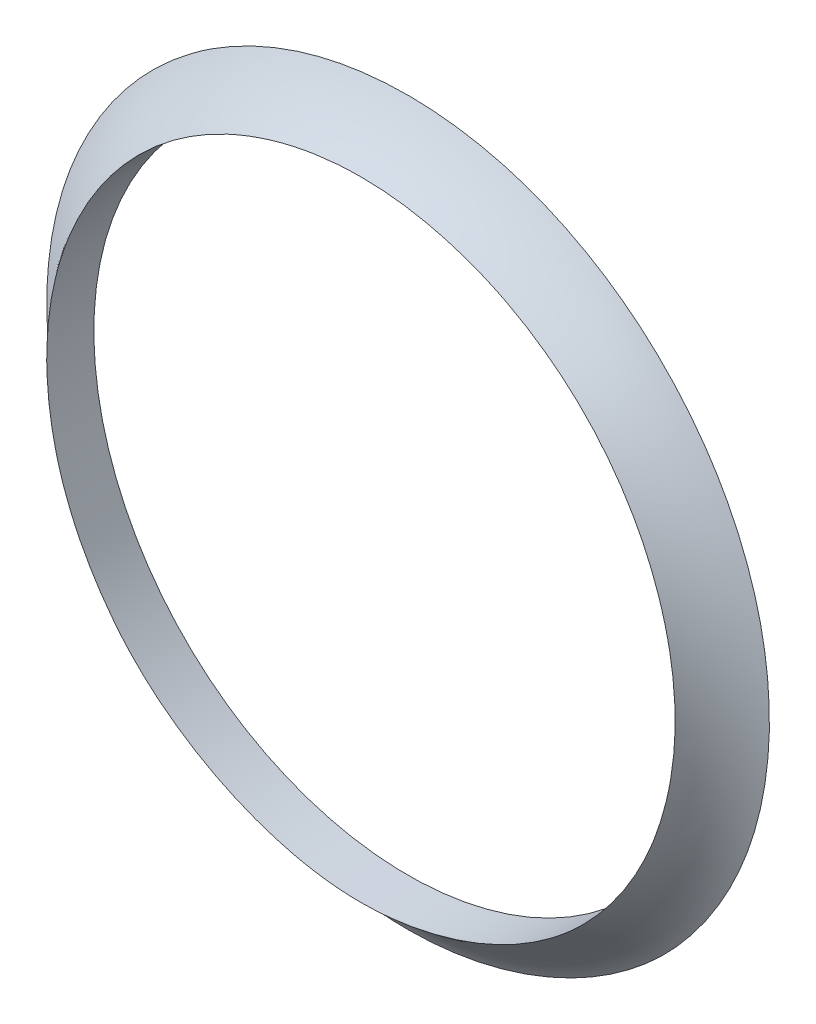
ISO-10303-21;
HEADER;
FILE_DESCRIPTION(('STEP AP214'),'2;1');
FILE_NAME('part.step','',(''),(''),'','','');
FILE_SCHEMA(('AUTOMOTIVE_DESIGN { 1 0 10303 214 1 1 1 1 }'));
ENDSEC;
DATA;
#1=APPLICATION_CONTEXT('core data for automotive mechanical design processes');
#2=APPLICATION_PROTOCOL_DEFINITION('international standard','automotive_design',2000,#1);
#3=PRODUCT_CONTEXT('',#1,'mechanical');
#4=PRODUCT('Part','Part','',(#3));
#5=PRODUCT_RELATED_PRODUCT_CATEGORY('part','',(#4));
#6=PRODUCT_DEFINITION_FORMATION('','',#4);
#7=PRODUCT_DEFINITION_CONTEXT('part definition',#1,'design');
#8=PRODUCT_DEFINITION('design','',#6,#7);
#9=PRODUCT_DEFINITION_SHAPE('','',#8);
#10=(LENGTH_UNIT() NAMED_UNIT(*) SI_UNIT(.MILLI.,.METRE.));
#11=(NAMED_UNIT(*) PLANE_ANGLE_UNIT() SI_UNIT($,.RADIAN.));
#12=(NAMED_UNIT(*) SI_UNIT($,.STERADIAN.) SOLID_ANGLE_UNIT());
#13=UNCERTAINTY_MEASURE_WITH_UNIT(LENGTH_MEASURE(1.E-05),#10,'distance_accuracy_value','');
#14=(GEOMETRIC_REPRESENTATION_CONTEXT(3) GLOBAL_UNCERTAINTY_ASSIGNED_CONTEXT((#13)) GLOBAL_UNIT_ASSIGNED_CONTEXT((#10,
#11,#12)) REPRESENTATION_CONTEXT('',''));
#15=CARTESIAN_POINT('',(0.,0.,0.));
#16=DIRECTION('',(0.,0.,1.));
#17=DIRECTION('',(1.,0.,0.));
#18=AXIS2_PLACEMENT_3D('',#15,#16,#17);
#19=CARTESIAN_POINT('',(731.147205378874,740.649231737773,-97.4999999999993));
#20=DIRECTION('',(0.,0.,-1.));
#21=DIRECTION('',(-0.452439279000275,0.891795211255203,0.));
#22=AXIS2_PLACEMENT_3D('',#19,#20,#21);
#23=PLANE('',#22);
#24=CARTESIAN_POINT('',(718.031944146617,666.142048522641,-97.4999999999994));
#25=CARTESIAN_POINT('',(718.65473878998,666.142041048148,-97.4999999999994));
#26=CARTESIAN_POINT('',(719.277414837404,666.169535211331,-97.4999999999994));
#27=CARTESIAN_POINT('',(720.518391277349,666.277212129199,-97.4999999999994));
#28=CARTESIAN_POINT('',(721.136690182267,666.357412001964,-97.4999999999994));
#29=CARTESIAN_POINT('',(722.365902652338,666.568393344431,-97.4999999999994));
#30=CARTESIAN_POINT('',(722.976797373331,666.699283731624,-97.4999999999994));
#31=CARTESIAN_POINT('',(724.186164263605,667.009397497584,-97.4999999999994));
#32=CARTESIAN_POINT('',(724.784637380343,667.18861717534,-97.4999999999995));
#33=CARTESIAN_POINT('',(725.767547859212,667.525447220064,-97.4999999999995));
#34=CARTESIAN_POINT('',(726.156466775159,667.670153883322,-97.4999999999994));
#35=CARTESIAN_POINT('',(726.926319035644,667.97949521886,-97.4999999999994));
#36=CARTESIAN_POINT('',(727.307252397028,668.14412984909,-97.4999999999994));
#37=CARTESIAN_POINT('',(728.060112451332,668.492836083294,-97.4999999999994));
#38=CARTESIAN_POINT('',(728.43203909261,668.676907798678,-97.4999999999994));
#39=CARTESIAN_POINT('',(729.165461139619,669.063834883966,-97.4999999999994));
#40=CARTESIAN_POINT('',(729.526967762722,669.26666898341,-97.4999999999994));
#41=CARTESIAN_POINT('',(730.23892922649,669.69089805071,-97.4999999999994));
#42=CARTESIAN_POINT('',(730.589383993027,669.912293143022,-97.4999999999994));
#43=CARTESIAN_POINT('',(731.278162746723,670.373295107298,-97.4999999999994));
#44=CARTESIAN_POINT('',(731.616485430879,670.612903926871,-97.4999999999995));
#45=CARTESIAN_POINT('',(732.306760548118,671.130178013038,-97.4999999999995));
#46=CARTESIAN_POINT('',(732.657582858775,671.409353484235,-97.4999999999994));
#47=CARTESIAN_POINT('',(733.342026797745,671.988114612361,-97.4999999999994));
#48=CARTESIAN_POINT('',(733.675648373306,672.287700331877,-97.4999999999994));
#49=CARTESIAN_POINT('',(734.161770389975,672.751949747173,-97.4999999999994));
#50=CARTESIAN_POINT('',(734.321425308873,672.909177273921,-97.4999999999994));
#51=CARTESIAN_POINT('',(734.635793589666,673.228496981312,-97.4999999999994));
#52=CARTESIAN_POINT('',(734.790506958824,673.390589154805,-97.4999999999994));
#53=CARTESIAN_POINT('',(735.24722037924,673.88400974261,-97.4999999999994));
#54=CARTESIAN_POINT('',(735.54167710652,674.222370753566,-97.4999999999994));
#55=CARTESIAN_POINT('',(736.109792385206,674.916192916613,-97.4999999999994));
#56=CARTESIAN_POINT('',(736.383447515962,675.271656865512,-97.4999999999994));
#57=CARTESIAN_POINT('',(736.778009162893,675.816313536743,-97.4999999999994));
#58=CARTESIAN_POINT('',(736.906880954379,675.999783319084,-97.4999999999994));
#59=CARTESIAN_POINT('',(737.159346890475,676.370371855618,-97.4999999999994));
#60=CARTESIAN_POINT('',(737.282939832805,676.557491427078,-97.4999999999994));
#61=CARTESIAN_POINT('',(737.74476793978,677.278955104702,-97.4999999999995));
#62=CARTESIAN_POINT('',(738.064292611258,677.825475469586,-97.4999999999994));
#63=CARTESIAN_POINT('',(738.657684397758,678.942725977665,-97.4999999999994));
#64=CARTESIAN_POINT('',(738.931548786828,679.513457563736,-97.4999999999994));
#65=CARTESIAN_POINT('',(739.430894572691,680.675467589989,-97.4999999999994));
#66=CARTESIAN_POINT('',(739.656395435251,681.266737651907,-97.4999999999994));
#67=CARTESIAN_POINT('',(740.056923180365,682.46626126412,-97.4999999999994));
#68=CARTESIAN_POINT('',(740.231946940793,683.074515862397,-97.4999999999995));
#69=CARTESIAN_POINT('',(740.457140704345,684.001813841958,-97.4999999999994));
#70=CARTESIAN_POINT('',(740.526436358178,684.316335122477,-97.4999999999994));
#71=CARTESIAN_POINT('',(740.651666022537,684.948044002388,-97.4999999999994));
#72=CARTESIAN_POINT('',(740.707600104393,685.265231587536,-97.4999999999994));
#73=CARTESIAN_POINT('',(740.806239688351,685.90165683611,-97.4999999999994));
#74=CARTESIAN_POINT('',(740.848944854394,686.220894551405,-97.4999999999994));
#75=CARTESIAN_POINT('',(740.921139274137,686.860863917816,-97.4999999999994));
#76=CARTESIAN_POINT('',(740.950628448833,687.18159557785,-97.4999999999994));
#77=CARTESIAN_POINT('',(740.996332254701,687.824118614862,-97.4999999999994));
#78=CARTESIAN_POINT('',(741.012542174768,688.145910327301,-97.4999999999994));
#79=CARTESIAN_POINT('',(741.031464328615,688.789887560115,-97.4999999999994));
#80=CARTESIAN_POINT('',(741.034176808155,689.112073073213,-97.4999999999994));
#81=CARTESIAN_POINT('',(741.025994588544,689.756272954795,-97.4999999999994));
#82=CARTESIAN_POINT('',(741.015099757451,690.078287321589,-97.4999999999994));
#83=CARTESIAN_POINT('',(740.979960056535,690.721591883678,-97.4999999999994));
#84=CARTESIAN_POINT('',(740.955714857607,691.042882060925,-97.4999999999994));
#85=CARTESIAN_POINT('',(740.893664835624,691.687315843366,-97.4999999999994));
#86=CARTESIAN_POINT('',(740.855729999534,692.010446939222,-97.4999999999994));
#87=CARTESIAN_POINT('',(740.766367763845,692.654834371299,-97.4999999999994));
#88=CARTESIAN_POINT('',(740.714940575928,692.976090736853,-97.4999999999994));
#89=CARTESIAN_POINT('',(740.598481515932,693.616114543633,-97.4999999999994));
#90=CARTESIAN_POINT('',(740.533450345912,693.934882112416,-97.4999999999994));
#91=CARTESIAN_POINT('',(740.389706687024,694.569323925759,-97.4999999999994));
#92=CARTESIAN_POINT('',(740.310993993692,694.884998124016,-97.4999999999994));
#93=CARTESIAN_POINT('',(740.140043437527,695.512549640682,-97.4999999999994));
#94=CARTESIAN_POINT('',(740.04781010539,695.824428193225,-97.4999999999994));
#95=CARTESIAN_POINT('',(739.849982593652,696.443918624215,-97.4999999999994));
#96=CARTESIAN_POINT('',(739.744388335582,696.751530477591,-97.4999999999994));
#97=CARTESIAN_POINT('',(739.520106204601,697.36192292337,-97.4999999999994));
#98=CARTESIAN_POINT('',(739.401419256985,697.664703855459,-97.4999999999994));
#99=CARTESIAN_POINT('',(739.151270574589,698.265006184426,-97.4999999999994));
#100=CARTESIAN_POINT('',(739.019805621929,698.562526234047,-97.4999999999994));
#101=CARTESIAN_POINT('',(738.60994321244,699.439321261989,-97.4999999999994));
#102=CARTESIAN_POINT('',(738.313353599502,700.010223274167,-97.4999999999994));
#103=CARTESIAN_POINT('',(737.673534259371,701.12517335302,-97.4999999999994));
#104=CARTESIAN_POINT('',(737.330304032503,701.669221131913,-97.4999999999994));
#105=CARTESIAN_POINT('',(736.599400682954,702.726866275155,-97.4999999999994));
#106=CARTESIAN_POINT('',(736.211714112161,703.240454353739,-97.4999999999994));
#107=CARTESIAN_POINT('',(735.394890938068,704.233554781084,-97.4999999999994));
#108=CARTESIAN_POINT('',(734.965752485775,704.713065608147,-97.4999999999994));
#109=CARTESIAN_POINT('',(734.065114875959,705.638963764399,-97.4999999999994));
#110=CARTESIAN_POINT('',(733.593269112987,706.085013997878,-97.4999999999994));
#111=CARTESIAN_POINT('',(732.613808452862,706.935929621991,-97.4999999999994));
#112=CARTESIAN_POINT('',(732.106194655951,707.340796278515,-97.4999999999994));
#113=CARTESIAN_POINT('',(731.058787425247,708.106138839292,-97.4999999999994));
#114=CARTESIAN_POINT('',(730.51900340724,708.46662763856,-97.4999999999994));
#115=CARTESIAN_POINT('',(729.410833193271,709.140824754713,-97.4999999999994));
#116=CARTESIAN_POINT('',(728.842445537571,709.454530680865,-97.4999999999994));
#117=CARTESIAN_POINT('',(727.971317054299,709.888414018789,-97.4999999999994));
#118=CARTESIAN_POINT('',(727.677616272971,710.027021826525,-97.4999999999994));
#119=CARTESIAN_POINT('',(727.084597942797,710.291695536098,-97.4999999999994));
#120=CARTESIAN_POINT('',(726.785280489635,710.417761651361,-97.4999999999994));
#121=CARTESIAN_POINT('',(726.181570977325,710.657019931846,-97.4999999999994));
#122=CARTESIAN_POINT('',(725.877179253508,710.770212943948,-97.4999999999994));
#123=CARTESIAN_POINT('',(725.263812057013,710.983421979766,-97.4999999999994));
#124=CARTESIAN_POINT('',(724.954836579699,711.083437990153,-97.4999999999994));
#125=CARTESIAN_POINT('',(724.332808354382,711.270078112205,-97.4999999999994));
#126=CARTESIAN_POINT('',(724.019754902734,711.356699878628,-97.4999999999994));
#127=CARTESIAN_POINT('',(723.39017024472,711.51638406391,-97.4999999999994));
#128=CARTESIAN_POINT('',(723.07363864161,711.589444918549,-97.4999999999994));
#129=CARTESIAN_POINT('',(722.437717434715,711.721922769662,-97.4999999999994));
#130=CARTESIAN_POINT('',(722.118327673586,711.781339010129,-97.4999999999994));
#131=CARTESIAN_POINT('',(721.477366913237,711.8866651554,-97.4999999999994));
#132=CARTESIAN_POINT('',(721.155796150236,711.932576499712,-97.4999999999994));
#133=CARTESIAN_POINT('',(720.514798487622,712.010491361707,-97.4999999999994));
#134=CARTESIAN_POINT('',(720.19539060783,712.042651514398,-97.4999999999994));
#135=CARTESIAN_POINT('',(719.5555259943,712.093788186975,-97.4999999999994));
#136=CARTESIAN_POINT('',(719.235069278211,712.112764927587,-97.4999999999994));
#137=CARTESIAN_POINT('',(718.59364431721,712.137385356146,-97.4999999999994));
#138=CARTESIAN_POINT('',(718.272676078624,712.143029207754,-97.4999999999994));
#139=CARTESIAN_POINT('',(717.630788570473,712.140786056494,-97.4999999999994));
#140=CARTESIAN_POINT('',(717.309869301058,712.132899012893,-97.4999999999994));
#141=CARTESIAN_POINT('',(716.668678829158,712.103835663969,-97.4999999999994));
#142=CARTESIAN_POINT('',(716.348407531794,712.082661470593,-97.4999999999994));
#143=CARTESIAN_POINT('',(715.709036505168,712.027148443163,-97.4999999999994));
#144=CARTESIAN_POINT('',(715.389936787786,711.992809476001,-97.4999999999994));
#145=CARTESIAN_POINT('',(714.435140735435,711.87010184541,-97.4999999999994));
#146=CARTESIAN_POINT('',(713.801796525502,711.76203558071,-97.4999999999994));
#147=CARTESIAN_POINT('',(712.855588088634,711.558965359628,-97.4999999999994));
#148=CARTESIAN_POINT('',(712.538333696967,711.4836863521,-97.4999999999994));
#149=CARTESIAN_POINT('',(711.90738571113,711.319475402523,-97.4999999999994));
#150=CARTESIAN_POINT('',(711.593691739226,711.230544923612,-97.4999999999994));
#151=CARTESIAN_POINT('',(710.970420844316,711.03919081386,-97.4999999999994));
#152=CARTESIAN_POINT('',(710.660844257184,710.936766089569,-97.4999999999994));
#153=CARTESIAN_POINT('',(710.046411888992,710.718680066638,-97.4999999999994));
#154=CARTESIAN_POINT('',(709.741556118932,710.603018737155,-97.4999999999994));
#155=CARTESIAN_POINT('',(708.834834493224,710.23668408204,-97.4999999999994));
#156=CARTESIAN_POINT('',(708.24067151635,709.966616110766,-97.4999999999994));
#157=CARTESIAN_POINT('',(707.077459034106,709.377139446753,-97.4999999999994));
#158=CARTESIAN_POINT('',(706.508409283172,709.057731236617,-97.4999999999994));
#159=CARTESIAN_POINT('',(705.408136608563,708.377145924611,-97.4999999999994));
#160=CARTESIAN_POINT('',(704.876460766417,708.016701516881,-97.4999999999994));
#161=CARTESIAN_POINT('',(703.845051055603,707.252716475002,-97.4999999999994));
#162=CARTESIAN_POINT('',(703.345316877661,706.849176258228,-97.4999999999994));
#163=CARTESIAN_POINT('',(702.38101645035,706.001957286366,-97.4999999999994));
#164=CARTESIAN_POINT('',(701.91645446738,705.558273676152,-97.4999999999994));
#165=CARTESIAN_POINT('',(701.025699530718,704.63393650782,-97.4999999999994));
#166=CARTESIAN_POINT('',(700.599506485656,704.153283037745,-97.4999999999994));
#167=CARTESIAN_POINT('',(699.783306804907,703.151697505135,-97.4999999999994));
#168=CARTESIAN_POINT('',(699.393842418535,702.63032316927,-97.4999999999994));
#169=CARTESIAN_POINT('',(698.660445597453,701.556475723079,-97.4999999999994));
#170=CARTESIAN_POINT('',(698.316514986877,701.004001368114,-97.4999999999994));
#171=CARTESIAN_POINT('',(697.676635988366,699.872006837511,-97.4999999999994));
#172=CARTESIAN_POINT('',(697.380676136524,699.292493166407,-97.4999999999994));
#173=CARTESIAN_POINT('',(696.974377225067,698.406186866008,-97.4999999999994));
#174=CARTESIAN_POINT('',(696.845209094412,698.107888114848,-97.4999999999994));
#175=CARTESIAN_POINT('',(696.599662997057,697.506039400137,-97.4999999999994));
#176=CARTESIAN_POINT('',(696.483285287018,697.202489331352,-97.4999999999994));
#177=CARTESIAN_POINT('',(696.264201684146,696.592151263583,-97.4999999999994));
#178=CARTESIAN_POINT('',(696.161432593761,696.285385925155,-97.4999999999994));
#179=CARTESIAN_POINT('',(695.969160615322,695.667756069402,-97.4999999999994));
#180=CARTESIAN_POINT('',(695.879656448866,695.356891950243,-97.4999999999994));
#181=CARTESIAN_POINT('',(695.714064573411,694.731581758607,-97.4999999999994));
#182=CARTESIAN_POINT('',(695.637978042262,694.417135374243,-97.4999999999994));
#183=CARTESIAN_POINT('',(695.499340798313,693.785273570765,-97.4999999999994));
#184=CARTESIAN_POINT('',(695.436790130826,693.467858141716,-97.4999999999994));
#185=CARTESIAN_POINT('',(695.325107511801,692.830622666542,-97.4999999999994));
#186=CARTESIAN_POINT('',(695.275977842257,692.510802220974,-97.4999999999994));
#187=CARTESIAN_POINT('',(695.191062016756,691.869394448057,-97.4999999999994));
#188=CARTESIAN_POINT('',(695.155276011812,691.547807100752,-97.4999999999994));
#189=CARTESIAN_POINT('',(695.097084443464,690.903420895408,-97.4999999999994));
#190=CARTESIAN_POINT('',(695.074678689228,690.580622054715,-97.4999999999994));
#191=CARTESIAN_POINT('',(695.043357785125,689.934403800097,-97.4999999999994));
#192=CARTESIAN_POINT('',(695.03444233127,689.610984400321,-97.4999999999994));
#193=CARTESIAN_POINT('',(695.028338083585,688.642639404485,-97.4999999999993));
#194=CARTESIAN_POINT('',(695.051590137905,687.997422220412,-97.4999999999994));
#195=CARTESIAN_POINT('',(695.126363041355,687.032962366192,-97.4999999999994));
#196=CARTESIAN_POINT('',(695.157943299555,686.711994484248,-97.4999999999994));
#197=CARTESIAN_POINT('',(695.234353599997,686.071610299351,-97.4999999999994));
#198=CARTESIAN_POINT('',(695.279183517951,685.752193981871,-97.4999999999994));
#199=CARTESIAN_POINT('',(695.3821255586,685.11550709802,-97.4999999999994));
#200=CARTESIAN_POINT('',(695.440237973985,684.798236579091,-97.4999999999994));
#201=CARTESIAN_POINT('',(695.569889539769,684.166443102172,-97.4999999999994));
#202=CARTESIAN_POINT('',(695.641428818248,683.851920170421,-97.4999999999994));
#203=CARTESIAN_POINT('',(695.797889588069,683.226265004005,-97.4999999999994));
#204=CARTESIAN_POINT('',(695.882809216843,682.91513230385,-97.4999999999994));
#205=CARTESIAN_POINT('',(696.065913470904,682.296791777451,-97.4999999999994));
#206=CARTESIAN_POINT('',(696.164098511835,681.989584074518,-97.4999999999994));
#207=CARTESIAN_POINT('',(696.408582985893,681.277613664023,-97.4999999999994));
#208=CARTESIAN_POINT('',(696.559990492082,680.874593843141,-97.4999999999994));
#209=CARTESIAN_POINT('',(696.885424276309,680.077763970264,-97.4999999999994));
#210=CARTESIAN_POINT('',(697.059452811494,679.683954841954,-97.4999999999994));
#211=CARTESIAN_POINT('',(697.429307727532,678.906667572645,-97.4999999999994));
#212=CARTESIAN_POINT('',(697.625136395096,678.523190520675,-97.4999999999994));
#213=CARTESIAN_POINT('',(698.037694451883,677.767793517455,-97.4999999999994));
#214=CARTESIAN_POINT('',(698.254416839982,677.395869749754,-97.4999999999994));
#215=CARTESIAN_POINT('',(698.594565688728,676.847399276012,-97.4999999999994));
#216=CARTESIAN_POINT('',(698.710461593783,676.666142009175,-97.4999999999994));
#217=CARTESIAN_POINT('',(698.947173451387,676.306869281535,-97.4999999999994));
#218=CARTESIAN_POINT('',(699.067989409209,676.128853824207,-97.4999999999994));
#219=CARTESIAN_POINT('',(699.437749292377,675.599947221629,-97.4999999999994));
#220=CARTESIAN_POINT('',(699.694037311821,675.254144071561,-97.4999999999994));
#221=CARTESIAN_POINT('',(700.227703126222,674.575483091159,-97.4999999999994));
#222=CARTESIAN_POINT('',(700.505210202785,674.242727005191,-97.4999999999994));
#223=CARTESIAN_POINT('',(701.079313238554,673.594098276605,-97.4999999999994));
#224=CARTESIAN_POINT('',(701.375908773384,673.278225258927,-97.4999999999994));
#225=CARTESIAN_POINT('',(701.987462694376,672.664820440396,-97.4999999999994));
#226=CARTESIAN_POINT('',(702.302420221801,672.367287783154,-97.4999999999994));
#227=CARTESIAN_POINT('',(702.949197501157,671.791012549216,-97.4999999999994));
#228=CARTESIAN_POINT('',(703.281021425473,671.512274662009,-97.4999999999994));
#229=CARTESIAN_POINT('',(703.959986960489,670.974048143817,-97.4999999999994));
#230=CARTESIAN_POINT('',(704.307130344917,670.714561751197,-97.4999999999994));
#231=CARTESIAN_POINT('',(705.015284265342,670.215297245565,-97.4999999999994));
#232=CARTESIAN_POINT('',(705.376295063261,669.975519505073,-97.4999999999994));
#233=CARTESIAN_POINT('',(706.280177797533,669.410203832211,-97.4999999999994));
#234=CARTESIAN_POINT('',(706.830217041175,669.09604191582,-97.4999999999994));
#235=CARTESIAN_POINT('',(707.953269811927,668.512080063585,-97.4999999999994));
#236=CARTESIAN_POINT('',(708.526282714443,668.242278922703,-97.4999999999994));
#237=CARTESIAN_POINT('',(709.691503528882,667.748725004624,-97.4999999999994));
#238=CARTESIAN_POINT('',(710.283701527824,667.524948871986,-97.4999999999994));
#239=CARTESIAN_POINT('',(711.48384305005,667.125211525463,-97.4999999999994));
#240=CARTESIAN_POINT('',(712.091783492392,666.949241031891,-97.4999999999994));
#241=CARTESIAN_POINT('',(713.576813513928,666.584007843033,-97.4999999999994));
#242=CARTESIAN_POINT('',(714.460237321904,666.419906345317,-97.4999999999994));
#243=CARTESIAN_POINT('',(716.239845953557,666.198983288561,-97.4999999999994));
#244=CARTESIAN_POINT('',(717.136017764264,666.142059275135,-97.4999999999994));
#245=CARTESIAN_POINT('',(718.031944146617,666.142048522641,-97.4999999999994));
#246=B_SPLINE_CURVE_WITH_KNOTS('',3,(#24,#25,#26,#27,#28,#29,#30,#31,#32,#33,#34,#35,#36,#37,
#38,#39,#40,#41,#42,#43,#44,#45,#46,#47,#48,#49,#50,#51,#52,#53,#54,#55,#56,#57,#58,#59,#60,#61,
#62,#63,#64,#65,#66,#67,#68,#69,#70,#71,#72,#73,#74,#75,#76,#77,#78,#79,#80,#81,#82,#83,#84,#85,
#86,#87,#88,#89,#90,#91,#92,#93,#94,#95,#96,#97,#98,#99,#100,#101,#102,#103,#104,#105,#106,#107,
#108,#109,#110,#111,#112,#113,#114,#115,#116,#117,#118,#119,#120,#121,#122,#123,#124,#125,#126,
#127,#128,#129,#130,#131,#132,#133,#134,#135,#136,#137,#138,#139,#140,#141,#142,#143,#144,#145,
#146,#147,#148,#149,#150,#151,#152,#153,#154,#155,#156,#157,#158,#159,#160,#161,#162,#163,#164,
#165,#166,#167,#168,#169,#170,#171,#172,#173,#174,#175,#176,#177,#178,#179,#180,#181,#182,#183,
#184,#185,#186,#187,#188,#189,#190,#191,#192,#193,#194,#195,#196,#197,#198,#199,#200,#201,#202,
#203,#204,#205,#206,#207,#208,#209,#210,#211,#212,#213,#214,#215,#216,#217,#218,#219,#220,#221,
#222,#223,#224,#225,#226,#227,#228,#229,#230,#231,#232,#233,#234,#235,#236,#237,#238,#239,#240,
#241,#242,#243,#244,#245),.UNSPECIFIED.,.T.,.F.,(4,2,2,2,2,2,2,2,2,2,2,2,2,2,2,2,2,2,2,2,2,2,2,
2,2,2,2,2,2,2,2,2,2,2,2,2,2,2,2,2,2,2,2,2,2,2,2,2,2,2,2,2,2,2,2,2,2,2,2,2,2,2,2,2,2,2,2,2,2,2,2,
2,2,2,2,2,2,2,2,2,2,2,2,2,2,2,2,2,2,2,2,2,2,2,2,2,2,2,2,2,2,2,2,2,2,2,2,2,2,2,4),(0.,
1.86762920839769,3.73586529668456,5.60813809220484,7.48026755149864,8.72466558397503,
9.96906099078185,11.2134635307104,12.4564722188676,13.699489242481,14.9426393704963,
16.2869180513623,17.6312008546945,18.3033361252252,18.9754704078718,20.3202221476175,
21.6651945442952,22.3377335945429,23.0104250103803,24.9073292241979,26.8043466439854,
28.7005990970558,30.5969688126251,31.5629220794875,32.5288701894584,33.494842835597,
34.4608212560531,35.4271422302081,36.3934456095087,37.3597583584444,38.3260949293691,
39.3018615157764,40.2776127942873,41.2533137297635,42.2290292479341,43.2044185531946,
44.1798135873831,45.1551397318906,46.130712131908,48.0582973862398,49.9859032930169,
51.9140938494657,53.8423704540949,55.7880081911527,57.7335861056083,59.6785973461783,
61.6237079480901,62.5977653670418,63.5718062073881,64.5457829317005,65.5197606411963,
66.4939086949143,67.4681690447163,68.4424833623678,69.4166937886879,70.3794909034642,
71.3422718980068,72.3050410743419,73.2678131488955,74.2304322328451,75.1930610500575,
77.1178665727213,78.0958194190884,79.0736675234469,80.0515949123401,81.0295245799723,
82.9849371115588,84.9403305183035,86.8650925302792,88.7898359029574,90.7148123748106,
92.6397842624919,94.5897726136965,96.5398390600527,98.4894387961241,99.4643913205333,
100.43936340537,101.409635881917,102.379814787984,103.350078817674,104.320346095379,
105.290778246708,106.261221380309,107.231650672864,108.202058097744,110.136251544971,
111.103604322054,112.070948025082,113.038313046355,114.005687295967,114.972927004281,
115.940197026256,117.231032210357,118.521996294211,119.813095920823,121.103764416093,
121.749120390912,122.394477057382,123.685007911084,124.984147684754,126.283258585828,
127.582308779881,128.881681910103,130.181205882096,131.480754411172,133.37894949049,
135.277092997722,137.174270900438,139.071080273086,141.760345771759,144.447039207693),.UNSPECIFIED.);
#247=CARTESIAN_POINT('',(718.031944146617,666.142048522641,-97.4999999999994));
#248=VERTEX_POINT('',#247);
#249=EDGE_CURVE('E61',#248,#248,#246,.T.);
#250=ORIENTED_EDGE('',*,*,#249,.F.);
#251=EDGE_LOOP('',(#250));
#252=FACE_BOUND('',#251,.T.);
#253=CARTESIAN_POINT('',(718.031944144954,689.142048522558,-97.4999999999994));
#254=DIRECTION('',(0.,0.,-1.));
#255=DIRECTION('',(0.,1.,0.));
#256=AXIS2_PLACEMENT_3D('',#253,#254,#255);
#257=CIRCLE('',#256,20.);
#258=CARTESIAN_POINT('',(718.031944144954,709.142048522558,-97.4999999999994));
#259=VERTEX_POINT('',#258);
#260=EDGE_CURVE('E71',#259,#259,#257,.T.);
#261=ORIENTED_EDGE('',*,*,#260,.F.);
#262=EDGE_LOOP('',(#261));
#263=FACE_BOUND('',#262,.T.);
#264=ADVANCED_FACE('F54',(#252,#263),#23,.T.);
#265=CARTESIAN_POINT('',(718.031944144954,689.142048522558,-152.499999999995));
#266=DIRECTION('',(0.,0.,0.999999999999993));
#267=DIRECTION('',(0.0973225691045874,0.995252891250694,0.));
#268=AXIS2_PLACEMENT_3D('',#265,#266,#267);
#269=CYLINDRICAL_SURFACE('',#268,20.);
#270=ORIENTED_EDGE('',*,*,#260,.T.);
#271=EDGE_LOOP('',(#270));
#272=FACE_BOUND('',#271,.T.);
#273=CARTESIAN_POINT('',(718.031944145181,669.142048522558,-94.4999999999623));
#274=CARTESIAN_POINT('',(717.471011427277,669.142052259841,-94.4999989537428));
#275=CARTESIAN_POINT('',(716.909974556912,669.165667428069,-94.5033156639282));
#276=CARTESIAN_POINT('',(715.791804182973,669.259977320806,-94.5132380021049));
#277=CARTESIAN_POINT('',(715.234671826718,669.330685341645,-94.5198445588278));
#278=CARTESIAN_POINT('',(714.127708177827,669.518784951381,-94.5334828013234));
#279=CARTESIAN_POINT('',(713.577885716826,669.636228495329,-94.5405149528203));
#280=CARTESIAN_POINT('',(712.490054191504,669.916989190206,-94.5528189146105));
#281=CARTESIAN_POINT('',(711.952044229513,670.080302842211,-94.5580908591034));
#282=CARTESIAN_POINT('',(711.068347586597,670.38974806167,-94.5642832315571));
#283=CARTESIAN_POINT('',(710.718273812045,670.523493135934,-94.5660680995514));
#284=CARTESIAN_POINT('',(710.026156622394,670.810445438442,-94.5680652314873));
#285=CARTESIAN_POINT('',(709.684113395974,670.963653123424,-94.568277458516));
#286=CARTESIAN_POINT('',(709.009181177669,671.289034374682,-94.5670936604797));
#287=CARTESIAN_POINT('',(708.676292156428,671.461207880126,-94.5656976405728));
#288=CARTESIAN_POINT('',(708.020786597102,671.82393648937,-94.5614408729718));
#289=CARTESIAN_POINT('',(707.698167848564,672.014487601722,-94.5585804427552));
#290=CARTESIAN_POINT('',(707.064147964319,672.413398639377,-94.5517165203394));
#291=CARTESIAN_POINT('',(706.752746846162,672.621758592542,-94.5477130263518));
#292=CARTESIAN_POINT('',(706.14213985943,673.055631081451,-94.5390711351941));
#293=CARTESIAN_POINT('',(705.842934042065,673.281143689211,-94.5344327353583));
#294=CARTESIAN_POINT('',(705.257897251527,673.748421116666,-94.5252258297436));
#295=CARTESIAN_POINT('',(704.972055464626,673.990172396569,-94.5206572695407));
#296=CARTESIAN_POINT('',(704.414378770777,674.489336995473,-94.5124749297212));
#297=CARTESIAN_POINT('',(704.142543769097,674.746750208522,-94.5088611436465));
#298=CARTESIAN_POINT('',(703.61373606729,675.276432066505,-94.5036704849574));
#299=CARTESIAN_POINT('',(703.356763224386,675.548700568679,-94.5020935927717));
#300=CARTESIAN_POINT('',(702.858494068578,676.107230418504,-94.5004293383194));
#301=CARTESIAN_POINT('',(702.617198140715,676.393492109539,-94.5003420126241));
#302=CARTESIAN_POINT('',(702.15103414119,676.979123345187,-94.500853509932));
#303=CARTESIAN_POINT('',(701.926166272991,677.27849305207,-94.5014523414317));
#304=CARTESIAN_POINT('',(701.601751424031,677.736620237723,-94.5020991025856));
#305=CARTESIAN_POINT('',(701.495757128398,677.890847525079,-94.5022727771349));
#306=CARTESIAN_POINT('',(701.288135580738,678.202217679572,-94.5024170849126));
#307=CARTESIAN_POINT('',(701.18650850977,678.359360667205,-94.5023877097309));
#308=CARTESIAN_POINT('',(700.78868243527,678.993876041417,-94.5019233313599));
#309=CARTESIAN_POINT('',(700.510240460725,679.482564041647,-94.5007940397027));
#310=CARTESIAN_POINT('',(699.995511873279,680.481626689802,-94.4978864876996));
#311=CARTESIAN_POINT('',(699.759225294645,680.992001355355,-94.4961082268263));
#312=CARTESIAN_POINT('',(699.437676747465,681.771010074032,-94.4939892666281));
#313=CARTESIAN_POINT('',(699.335964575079,682.032950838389,-94.493374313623));
#314=CARTESIAN_POINT('',(699.143661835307,682.56088474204,-94.4924696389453));
#315=CARTESIAN_POINT('',(699.05307131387,682.826877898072,-94.4921799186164));
#316=CARTESIAN_POINT('',(698.798248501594,683.630200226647,-94.4919140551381));
#317=CARTESIAN_POINT('',(698.650916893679,684.172988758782,-94.4925408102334));
#318=CARTESIAN_POINT('',(698.40241274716,685.269371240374,-94.4949967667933));
#319=CARTESIAN_POINT('',(698.301267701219,685.822971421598,-94.4968266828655));
#320=CARTESIAN_POINT('',(698.184794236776,686.658152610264,-94.498724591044));
#321=CARTESIAN_POINT('',(698.151842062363,686.93737447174,-94.4992160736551));
#322=CARTESIAN_POINT('',(698.097734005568,687.496976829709,-94.4998747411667));
#323=CARTESIAN_POINT('',(698.076578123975,687.777357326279,-94.5000419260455));
#324=CARTESIAN_POINT('',(698.046105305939,688.33875578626,-94.5001309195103));
#325=CARTESIAN_POINT('',(698.036788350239,688.619773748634,-94.5000527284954));
#326=CARTESIAN_POINT('',(698.030008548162,689.181953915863,-94.5000010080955));
#327=CARTESIAN_POINT('',(698.032545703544,689.463116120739,-94.5000274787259));
#328=CARTESIAN_POINT('',(698.049469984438,690.025083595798,-94.5000300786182));
#329=CARTESIAN_POINT('',(698.063857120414,690.305888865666,-94.5000062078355));
#330=CARTESIAN_POINT('',(698.104455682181,690.866643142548,-94.4996670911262));
#331=CARTESIAN_POINT('',(698.130667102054,691.146592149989,-94.4993518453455));
#332=CARTESIAN_POINT('',(698.194868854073,691.705146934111,-94.4984188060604));
#333=CARTESIAN_POINT('',(698.232859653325,691.98375265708,-94.4978010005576));
#334=CARTESIAN_POINT('',(698.32055222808,692.539114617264,-94.4963984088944));
#335=CARTESIAN_POINT('',(698.370254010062,692.815870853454,-94.4956136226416));
#336=CARTESIAN_POINT('',(698.481280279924,693.367042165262,-94.4942409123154));
#337=CARTESIAN_POINT('',(698.542604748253,693.641457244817,-94.4936529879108));
#338=CARTESIAN_POINT('',(698.676767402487,694.187458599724,-94.4928138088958));
#339=CARTESIAN_POINT('',(698.749605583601,694.459044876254,-94.4925625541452));
#340=CARTESIAN_POINT('',(698.906666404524,694.998906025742,-94.4924114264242));
#341=CARTESIAN_POINT('',(698.990889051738,695.267180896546,-94.4925115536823));
#342=CARTESIAN_POINT('',(699.170568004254,695.799940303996,-94.4930141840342));
#343=CARTESIAN_POINT('',(699.266024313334,696.064424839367,-94.4934166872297));
#344=CARTESIAN_POINT('',(699.468004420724,696.58913933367,-94.4943844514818));
#345=CARTESIAN_POINT('',(699.574528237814,696.849369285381,-94.4949497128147));
#346=CARTESIAN_POINT('',(699.798441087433,697.365090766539,-94.4960796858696));
#347=CARTESIAN_POINT('',(699.915830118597,697.620582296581,-94.4966443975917));
#348=CARTESIAN_POINT('',(700.284000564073,698.379275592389,-94.4983046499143));
#349=CARTESIAN_POINT('',(700.550829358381,698.874810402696,-94.4993665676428));
#350=CARTESIAN_POINT('',(701.125246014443,699.841572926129,-94.5013653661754));
#351=CARTESIAN_POINT('',(701.432833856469,700.31280065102,-94.5023022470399));
#352=CARTESIAN_POINT('',(702.086620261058,701.227689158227,-94.5040747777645));
#353=CARTESIAN_POINT('',(702.432818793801,701.671349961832,-94.5049104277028));
#354=CARTESIAN_POINT('',(703.161356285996,702.527927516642,-94.5060773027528));
#355=CARTESIAN_POINT('',(703.543695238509,702.940844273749,-94.5064085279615));
#356=CARTESIAN_POINT('',(704.341813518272,703.733020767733,-94.5063493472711));
#357=CARTESIAN_POINT('',(704.7575942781,704.112279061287,-94.5059589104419));
#358=CARTESIAN_POINT('',(705.619631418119,704.834423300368,-94.5047075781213));
#359=CARTESIAN_POINT('',(706.06588780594,705.177309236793,-94.5038466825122));
#360=CARTESIAN_POINT('',(706.985680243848,705.824261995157,-94.5020477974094));
#361=CARTESIAN_POINT('',(707.459216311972,706.128328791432,-94.5011098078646));
#362=CARTESIAN_POINT('',(708.430291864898,706.695519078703,-94.4990950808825));
#363=CARTESIAN_POINT('',(708.927831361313,706.95864254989,-94.4980183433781));
#364=CARTESIAN_POINT('',(709.689294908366,707.321139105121,-94.4963447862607));
#365=CARTESIAN_POINT('',(709.945671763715,707.436617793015,-94.4957771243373));
#366=CARTESIAN_POINT('',(710.46308291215,707.656673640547,-94.4946556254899));
#367=CARTESIAN_POINT('',(710.724117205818,707.761250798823,-94.4941017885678));
#368=CARTESIAN_POINT('',(711.250358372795,707.959305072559,-94.4931911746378));
#369=CARTESIAN_POINT('',(711.515565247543,708.05278218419,-94.492834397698));
#370=CARTESIAN_POINT('',(712.049684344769,708.22847305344,-94.4924381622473));
#371=CARTESIAN_POINT('',(712.31859655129,708.310686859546,-94.4923987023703));
#372=CARTESIAN_POINT('',(712.859647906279,708.463704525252,-94.4926721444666));
#373=CARTESIAN_POINT('',(713.131787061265,708.5345083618,-94.4929850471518));
#374=CARTESIAN_POINT('',(713.678808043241,708.664580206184,-94.4939455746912));
#375=CARTESIAN_POINT('',(713.953689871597,708.723848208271,-94.4945931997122));
#376=CARTESIAN_POINT('',(714.505707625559,708.830743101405,-94.4960230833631));
#377=CARTESIAN_POINT('',(714.782843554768,708.878369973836,-94.4968053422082));
#378=CARTESIAN_POINT('',(715.338877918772,708.9618979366,-94.4981610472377));
#379=CARTESIAN_POINT('',(715.617776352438,708.997799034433,-94.4987344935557));
#380=CARTESIAN_POINT('',(716.176824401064,709.05781022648,-94.4995657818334));
#381=CARTESIAN_POINT('',(716.456973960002,709.081920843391,-94.4998236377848));
#382=CARTESIAN_POINT('',(717.018049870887,709.118310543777,-94.5000741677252));
#383=CARTESIAN_POINT('',(717.298976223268,709.130589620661,-94.5000668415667));
#384=CARTESIAN_POINT('',(717.720548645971,709.14011831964,-94.5000223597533));
#385=CARTESIAN_POINT('',(717.861107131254,709.141812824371,-94.500001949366));
#386=CARTESIAN_POINT('',(718.142228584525,709.142238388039,-94.4999986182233));
#387=CARTESIAN_POINT('',(718.282791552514,709.140969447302,-94.5000156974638));
#388=CARTESIAN_POINT('',(718.704390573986,709.132717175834,-94.5000602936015));
#389=CARTESIAN_POINT('',(718.985352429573,709.121288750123,-94.5000811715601));
#390=CARTESIAN_POINT('',(719.546535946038,709.086597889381,-94.4998667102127));
#391=CARTESIAN_POINT('',(719.826757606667,709.063335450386,-94.4996313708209));
#392=CARTESIAN_POINT('',(720.385971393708,709.005018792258,-94.4988435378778));
#393=CARTESIAN_POINT('',(720.664963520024,708.969964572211,-94.498291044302));
#394=CARTESIAN_POINT('',(721.221227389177,708.888123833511,-94.4969634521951));
#395=CARTESIAN_POINT('',(721.498499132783,708.841337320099,-94.4961883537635));
#396=CARTESIAN_POINT('',(722.050799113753,708.73612605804,-94.4947420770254));
#397=CARTESIAN_POINT('',(722.325827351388,708.677701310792,-94.4940708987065));
#398=CARTESIAN_POINT('',(723.146874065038,708.485091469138,-94.4925694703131));
#399=CARTESIAN_POINT('',(723.688975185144,708.333553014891,-94.4922508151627));
#400=CARTESIAN_POINT('',(724.490893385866,708.072477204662,-94.4927684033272));
#401=CARTESIAN_POINT('',(724.75635617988,707.979811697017,-94.4931069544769));
#402=CARTESIAN_POINT('',(725.283147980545,707.783374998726,-94.4939921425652));
#403=CARTESIAN_POINT('',(725.544476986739,707.679603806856,-94.4945387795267));
#404=CARTESIAN_POINT('',(726.321526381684,707.351901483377,-94.4962084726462));
#405=CARTESIAN_POINT('',(726.830428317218,707.111542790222,-94.4973615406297));
#406=CARTESIAN_POINT('',(727.826110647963,706.588840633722,-94.4995036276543));
#407=CARTESIAN_POINT('',(728.312891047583,706.306497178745,-94.500492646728));
#408=CARTESIAN_POINT('',(729.260941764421,705.701809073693,-94.5024150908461));
#409=CARTESIAN_POINT('',(729.722212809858,705.379465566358,-94.5033485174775));
#410=CARTESIAN_POINT('',(730.615958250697,704.697070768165,-94.504972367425));
#411=CARTESIAN_POINT('',(731.048432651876,704.337019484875,-94.5056627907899));
#412=CARTESIAN_POINT('',(731.881516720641,703.581766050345,-94.5064137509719));
#413=CARTESIAN_POINT('',(732.282126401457,703.186563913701,-94.5064742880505));
#414=CARTESIAN_POINT('',(733.04863131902,702.363819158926,-94.505924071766));
#415=CARTESIAN_POINT('',(733.414526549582,701.936276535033,-94.5053133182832));
#416=CARTESIAN_POINT('',(734.109015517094,701.0518724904,-94.5037782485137));
#417=CARTESIAN_POINT('',(734.437607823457,700.595009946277,-94.5028539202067));
#418=CARTESIAN_POINT('',(735.055138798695,699.655229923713,-94.5009607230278));
#419=CARTESIAN_POINT('',(735.344077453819,699.172312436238,-94.4999918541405));
#420=CARTESIAN_POINT('',(735.880247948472,698.18384957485,-94.4978978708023));
#421=CARTESIAN_POINT('',(736.127479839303,697.678304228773,-94.4967727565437));
#422=CARTESIAN_POINT('',(736.578474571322,696.648205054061,-94.4945008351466));
#423=CARTESIAN_POINT('',(736.782237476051,696.123651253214,-94.4933540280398));
#424=CARTESIAN_POINT('',(737.14487295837,695.059143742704,-94.4922853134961));
#425=CARTESIAN_POINT('',(737.303743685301,694.519189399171,-94.4923634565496));
#426=CARTESIAN_POINT('',(737.507487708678,693.70081325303,-94.4935364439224));
#427=CARTESIAN_POINT('',(737.569647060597,693.426582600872,-94.4941035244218));
#428=CARTESIAN_POINT('',(737.682355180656,692.875726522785,-94.495453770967));
#429=CARTESIAN_POINT('',(737.732903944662,692.599101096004,-94.4962369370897));
#430=CARTESIAN_POINT('',(737.822292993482,692.043969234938,-94.4976573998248));
#431=CARTESIAN_POINT('',(737.861133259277,691.765462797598,-94.4982946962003));
#432=CARTESIAN_POINT('',(737.927038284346,691.207058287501,-94.4992697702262));
#433=CARTESIAN_POINT('',(737.954103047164,690.927160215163,-94.4996075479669));
#434=CARTESIAN_POINT('',(737.996408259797,690.366472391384,-94.4999871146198));
#435=CARTESIAN_POINT('',(738.011648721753,690.085682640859,-94.500028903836));
#436=CARTESIAN_POINT('',(738.030278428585,689.523710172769,-94.5000326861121));
#437=CARTESIAN_POINT('',(738.03366767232,689.242527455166,-94.4999946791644));
#438=CARTESIAN_POINT('',(738.028588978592,688.680282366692,-94.5000410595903));
#439=CARTESIAN_POINT('',(738.020121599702,688.399219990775,-94.500125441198));
#440=CARTESIAN_POINT('',(737.991345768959,687.837701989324,-94.5000652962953));
#441=CARTESIAN_POINT('',(737.971037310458,687.557246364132,-94.4999207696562));
#442=CARTESIAN_POINT('',(737.918615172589,686.997439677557,-94.4993066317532));
#443=CARTESIAN_POINT('',(737.886501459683,686.718088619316,-94.4988370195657));
#444=CARTESIAN_POINT('',(737.810526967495,686.160991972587,-94.4976130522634));
#445=CARTESIAN_POINT('',(737.766666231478,685.88324637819,-94.4968586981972));
#446=CARTESIAN_POINT('',(737.667272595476,685.329845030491,-94.495323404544));
#447=CARTESIAN_POINT('',(737.611739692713,685.054189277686,-94.4945424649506));
#448=CARTESIAN_POINT('',(737.489110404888,684.505481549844,-94.4932621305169));
#449=CARTESIAN_POINT('',(737.422013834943,684.232429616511,-94.4927627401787));
#450=CARTESIAN_POINT('',(737.203530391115,683.417879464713,-94.4918365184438));
#451=CARTESIAN_POINT('',(737.034926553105,682.880857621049,-94.4919811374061));
#452=CARTESIAN_POINT('',(736.716791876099,681.999419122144,-94.4933964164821));
#453=CARTESIAN_POINT('',(736.5796272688,681.650452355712,-94.4942757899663));
#454=CARTESIAN_POINT('',(736.285893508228,680.960743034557,-94.4962760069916));
#455=CARTESIAN_POINT('',(736.129324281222,680.620000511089,-94.4973968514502));
#456=CARTESIAN_POINT('',(735.797291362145,679.947867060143,-94.4994686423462));
#457=CARTESIAN_POINT('',(735.621827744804,679.616476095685,-94.5004195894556));
#458=CARTESIAN_POINT('',(735.252549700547,678.964071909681,-94.5018272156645));
#459=CARTESIAN_POINT('',(735.05873612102,678.643058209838,-94.5022839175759));
#460=CARTESIAN_POINT('',(734.754741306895,678.170120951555,-94.5024080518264));
#461=CARTESIAN_POINT('',(734.651191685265,678.013898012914,-94.5023559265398));
#462=CARTESIAN_POINT('',(734.439742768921,677.704423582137,-94.5020744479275));
#463=CARTESIAN_POINT('',(734.331843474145,677.551172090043,-94.5018450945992));
#464=CARTESIAN_POINT('',(734.001752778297,677.096067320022,-94.5011195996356));
#465=CARTESIAN_POINT('',(733.773147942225,676.798831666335,-94.5005859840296));
#466=CARTESIAN_POINT('',(733.299592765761,676.217676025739,-94.500388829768));
#467=CARTESIAN_POINT('',(733.054642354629,675.933756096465,-94.500725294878));
#468=CARTESIAN_POINT('',(732.675570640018,675.51856372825,-94.5024400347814));
#469=CARTESIAN_POINT('',(732.54726575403,675.381941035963,-94.5032133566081));
#470=CARTESIAN_POINT('',(732.286869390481,675.112357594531,-94.5052481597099));
#471=CARTESIAN_POINT('',(732.154777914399,674.979396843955,-94.5065096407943));
#472=CARTESIAN_POINT('',(731.752981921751,674.586171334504,-94.5109877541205));
#473=CARTESIAN_POINT('',(731.477732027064,674.331537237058,-94.5148981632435));
#474=CARTESIAN_POINT('',(730.913315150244,673.838099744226,-94.523464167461));
#475=CARTESIAN_POINT('',(730.624144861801,673.59930014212,-94.5281199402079));
#476=CARTESIAN_POINT('',(730.03283546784,673.138326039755,-94.5373374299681));
#477=CARTESIAN_POINT('',(729.730696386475,672.916151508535,-94.5418991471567));
#478=CARTESIAN_POINT('',(729.114408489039,672.489135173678,-94.550262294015));
#479=CARTESIAN_POINT('',(728.800259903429,672.284293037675,-94.5540637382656));
#480=CARTESIAN_POINT('',(728.160982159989,671.89261114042,-94.5604376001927));
#481=CARTESIAN_POINT('',(727.835854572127,671.705768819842,-94.5630101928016));
#482=CARTESIAN_POINT('',(727.17559872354,671.350643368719,-94.5666431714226));
#483=CARTESIAN_POINT('',(726.840470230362,671.182360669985,-94.5677035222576));
#484=CARTESIAN_POINT('',(726.161263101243,670.864884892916,-94.5682072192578));
#485=CARTESIAN_POINT('',(725.817183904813,670.715693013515,-94.5676504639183));
#486=CARTESIAN_POINT('',(725.121565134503,670.437035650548,-94.5649895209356));
#487=CARTESIAN_POINT('',(724.770034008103,670.30754906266,-94.5628870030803));
#488=CARTESIAN_POINT('',(724.060291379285,670.068526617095,-94.5573730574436));
#489=CARTESIAN_POINT('',(723.70208034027,669.958989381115,-94.5539617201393));
#490=CARTESIAN_POINT('',(722.980179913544,669.760224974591,-94.5462316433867));
#491=CARTESIAN_POINT('',(722.616492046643,669.670992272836,-94.5419131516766));
#492=CARTESIAN_POINT('',(721.904372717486,669.517325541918,-94.5331706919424));
#493=CARTESIAN_POINT('',(721.556172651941,669.451815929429,-94.5287648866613));
#494=CARTESIAN_POINT('',(720.856725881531,669.339369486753,-94.5202417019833));
#495=CARTESIAN_POINT('',(720.50547870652,669.292435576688,-94.5161243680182));
#496=CARTESIAN_POINT('',(719.801033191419,669.217296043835,-94.5088877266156));
#497=CARTESIAN_POINT('',(719.447835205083,669.189087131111,-94.5057682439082));
#498=CARTESIAN_POINT('',(718.740420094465,669.151461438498,-94.5013246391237));
#499=CARTESIAN_POINT('',(718.386202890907,669.142046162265,-94.5000006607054));
#500=CARTESIAN_POINT('',(718.031944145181,669.142048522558,-94.4999999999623));
#501=B_SPLINE_CURVE_WITH_KNOTS('',3,(#273,#274,#275,#276,#277,#278,#279,#280,#281,#282,#283,
#284,#285,#286,#287,#288,#289,#290,#291,#292,#293,#294,#295,#296,#297,#298,#299,#300,#301,#302,
#303,#304,#305,#306,#307,#308,#309,#310,#311,#312,#313,#314,#315,#316,#317,#318,#319,#320,#321,
#322,#323,#324,#325,#326,#327,#328,#329,#330,#331,#332,#333,#334,#335,#336,#337,#338,#339,#340,
#341,#342,#343,#344,#345,#346,#347,#348,#349,#350,#351,#352,#353,#354,#355,#356,#357,#358,#359,
#360,#361,#362,#363,#364,#365,#366,#367,#368,#369,#370,#371,#372,#373,#374,#375,#376,#377,#378,
#379,#380,#381,#382,#383,#384,#385,#386,#387,#388,#389,#390,#391,#392,#393,#394,#395,#396,#397,
#398,#399,#400,#401,#402,#403,#404,#405,#406,#407,#408,#409,#410,#411,#412,#413,#414,#415,#416,
#417,#418,#419,#420,#421,#422,#423,#424,#425,#426,#427,#428,#429,#430,#431,#432,#433,#434,#435,
#436,#437,#438,#439,#440,#441,#442,#443,#444,#445,#446,#447,#448,#449,#450,#451,#452,#453,#454,
#455,#456,#457,#458,#459,#460,#461,#462,#463,#464,#465,#466,#467,#468,#469,#470,#471,#472,#473,
#474,#475,#476,#477,#478,#479,#480,#481,#482,#483,#484,#485,#486,#487,#488,#489,#490,#491,#492,
#493,#494,#495,#496,#497,#498,#499,#500),.UNSPECIFIED.,.T.,.F.,(4,2,2,2,2,2,2,2,2,2,2,2,2,2,2,2,
2,2,2,2,2,2,2,2,2,2,2,2,2,2,2,2,2,2,2,2,2,2,2,2,2,2,2,2,2,2,2,2,2,2,2,2,2,2,2,2,2,2,2,2,2,2,2,2,
2,2,2,2,2,2,2,2,2,2,2,2,2,2,2,2,2,2,2,2,2,2,2,2,2,2,2,2,2,2,2,2,2,2,2,2,2,2,2,2,2,2,2,2,2,2,2,2,
2,4),(0.,1.68248513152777,3.36544550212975,5.05028203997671,6.73499009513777,7.85871906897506,
8.98247441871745,10.1062261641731,11.2297343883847,12.3532443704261,13.4767590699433,
14.5993483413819,15.7219300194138,16.8445009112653,17.9670993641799,19.0897117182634,
19.6510611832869,20.2124338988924,21.897591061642,23.5827495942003,24.4255175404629,
25.2682889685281,26.9534549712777,28.6396227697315,29.4828942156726,30.3261657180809,
31.1694358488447,32.0127061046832,32.8559771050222,33.6992476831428,34.5425517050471,
35.3858561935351,36.2291592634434,37.0724619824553,37.9157652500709,38.7590688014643,
39.6023737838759,40.4456786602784,42.1319220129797,43.8181645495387,45.5044057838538,
47.1906466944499,48.8769598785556,50.5632734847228,52.2495882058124,53.9359037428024,
54.7792529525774,55.6226022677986,56.4659518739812,57.3092978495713,58.1526455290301,
58.9959936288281,59.8393430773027,60.6826919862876,61.526003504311,62.3693154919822,
62.7909946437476,63.2126737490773,64.0559849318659,64.8992963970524,65.7426079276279,
66.5859190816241,67.4292301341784,69.115487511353,69.9588042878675,70.8021211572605,
72.4883801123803,74.1746387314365,75.8608491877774,77.5470593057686,79.23326872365,
80.9194784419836,82.6057528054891,84.2920277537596,85.9783006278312,87.6645710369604,
89.3509109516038,90.1942697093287,91.0376287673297,91.8809891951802,92.724349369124,
93.5677086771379,94.4110680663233,95.2543877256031,96.0977078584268,96.9410303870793,
97.7843498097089,98.6276694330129,99.4710025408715,101.157275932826,102.281636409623,
103.4060011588,104.530361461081,105.654669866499,106.21688131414,106.779092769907,
107.903401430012,109.027714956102,109.589927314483,110.152139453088,111.276457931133,
112.401044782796,113.525629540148,114.650192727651,115.774595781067,116.899024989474,
118.023524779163,119.146811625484,120.270020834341,121.392923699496,122.455437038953,
123.518117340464,124.580610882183,125.643189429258),.UNSPECIFIED.);
#502=CARTESIAN_POINT('',(718.031944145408,669.142048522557,-94.4999999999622));
#503=VERTEX_POINT('',#502);
#504=EDGE_CURVE('E11',#503,#503,#501,.T.);
#505=ORIENTED_EDGE('',*,*,#504,.F.);
#506=EDGE_LOOP('',(#505));
#507=FACE_BOUND('',#506,.T.);
#508=ADVANCED_FACE('F75',(#272,#507),#269,.F.);
#509=CARTESIAN_POINT('',(718.031944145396,669.164252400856,-94.4638477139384));
#510=CARTESIAN_POINT('',(723.270290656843,669.164252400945,-94.4638477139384));
#511=CARTESIAN_POINT('',(729.81822379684,671.962388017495,-94.4638477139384));
#512=CARTESIAN_POINT('',(734.69191845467,677.902237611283,-94.4638477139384));
#513=CARTESIAN_POINT('',(736.55272069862,681.312002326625,-94.4638477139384));
#514=CARTESIAN_POINT('',(737.72974557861,685.063480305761,-94.4638477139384));
#515=CARTESIAN_POINT('',(738.149677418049,689.142048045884,-94.4638477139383));
#516=CARTESIAN_POINT('',(737.729986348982,693.220618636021,-94.4638477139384));
#517=CARTESIAN_POINT('',(736.551757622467,696.972088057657,-94.4638477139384));
#518=CARTESIAN_POINT('',(734.695530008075,700.381884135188,-94.4638477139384));
#519=CARTESIAN_POINT('',(732.241588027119,703.351692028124,-94.4638477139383));
#520=CARTESIAN_POINT('',(729.271779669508,705.805635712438,-94.4638477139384));
#521=CARTESIAN_POINT('',(725.861983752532,707.661857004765,-94.4638477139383));
#522=CARTESIAN_POINT('',(722.1105141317,708.840109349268,-94.4638477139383));
#523=CARTESIAN_POINT('',(718.031944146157,709.259712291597,-94.4638477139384));
#524=CARTESIAN_POINT('',(713.953374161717,708.840109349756,-94.4638477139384));
#525=CARTESIAN_POINT('',(710.201904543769,707.661857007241,-94.4638477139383));
#526=CARTESIAN_POINT('',(706.792108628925,705.805635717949,-94.4638477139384));
#527=CARTESIAN_POINT('',(703.822300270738,703.351692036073,-94.4638477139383));
#528=CARTESIAN_POINT('',(701.368358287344,700.381884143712,-94.4638477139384));
#529=CARTESIAN_POINT('',(699.512130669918,696.972088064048,-94.4638477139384));
#530=CARTESIAN_POINT('',(698.333901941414,693.220618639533,-94.4638477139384));
#531=CARTESIAN_POINT('',(697.91421087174,689.142048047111,-94.4638477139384));
#532=CARTESIAN_POINT('',(698.334142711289,685.063480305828,-94.4638477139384));
#533=CARTESIAN_POINT('',(699.511167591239,681.312002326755,-94.4638477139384));
#534=CARTESIAN_POINT('',(701.371969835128,677.902237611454,-94.4638477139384));
#535=CARTESIAN_POINT('',(706.245664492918,671.962388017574,-94.4638477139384));
#536=CARTESIAN_POINT('',(712.793597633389,669.164252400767,-94.4638477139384));
#537=CARTESIAN_POINT('',(718.031944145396,669.164252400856,-94.4638477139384));
#538=CARTESIAN_POINT('',(718.0319441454,669.156851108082,-94.4758984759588));
#539=CARTESIAN_POINT('',(723.272233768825,669.156851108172,-94.4758984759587));
#540=CARTESIAN_POINT('',(729.822595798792,671.95603502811,-94.4758984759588));
#541=CARTESIAN_POINT('',(734.698085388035,677.898064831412,-94.4758984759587));
#542=CARTESIAN_POINT('',(736.559578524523,681.309083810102,-94.4758984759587));
#543=CARTESIAN_POINT('',(737.737041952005,685.061949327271,-94.4758984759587));
#544=CARTESIAN_POINT('',(738.157131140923,689.142048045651,-94.4758984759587));
#545=CARTESIAN_POINT('',(737.737282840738,693.222149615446,-94.4758984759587));
#546=CARTESIAN_POINT('',(736.558614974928,696.975006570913,-94.4758984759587));
#547=CARTESIAN_POINT('',(734.701698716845,700.386056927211,-94.4758984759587));
#548=CARTESIAN_POINT('',(732.246850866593,703.356954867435,-94.4758984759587));
#549=CARTESIAN_POINT('',(729.275952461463,705.811804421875,-94.4758984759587));
#550=CARTESIAN_POINT('',(725.864902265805,707.668714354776,-94.4758984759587));
#551=CARTESIAN_POINT('',(722.112045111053,708.847405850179,-94.4758984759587));
#552=CARTESIAN_POINT('',(718.031944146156,709.267165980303,-94.4758984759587));
#553=CARTESIAN_POINT('',(713.95184318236,708.847405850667,-94.4758984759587));
#554=CARTESIAN_POINT('',(710.198986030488,707.66871435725,-94.4758984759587));
#555=CARTESIAN_POINT('',(706.787935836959,705.811804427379,-94.4758984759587));
#556=CARTESIAN_POINT('',(703.817037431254,703.356954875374,-94.4758984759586));
#557=CARTESIAN_POINT('',(701.362189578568,700.386056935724,-94.4758984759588));
#558=CARTESIAN_POINT('',(699.505273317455,696.975006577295,-94.4758984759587));
#559=CARTESIAN_POINT('',(698.326605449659,693.222149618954,-94.4758984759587));
#560=CARTESIAN_POINT('',(697.906757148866,689.142048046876,-94.4758984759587));
#561=CARTESIAN_POINT('',(698.326846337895,685.061949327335,-94.4758984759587));
#562=CARTESIAN_POINT('',(699.504309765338,681.309083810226,-94.4758984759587));
#563=CARTESIAN_POINT('',(701.365802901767,677.898064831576,-94.4758984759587));
#564=CARTESIAN_POINT('',(706.241292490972,671.956035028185,-94.4758984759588));
#565=CARTESIAN_POINT('',(712.791654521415,669.156851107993,-94.4758984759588));
#566=CARTESIAN_POINT('',(718.0319441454,669.156851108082,-94.4758984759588));
#567=CARTESIAN_POINT('',(718.031944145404,669.149449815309,-94.4879492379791));
#568=CARTESIAN_POINT('',(723.274176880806,669.149449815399,-94.4879492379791));
#569=CARTESIAN_POINT('',(729.826967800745,671.949682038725,-94.4879492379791));
#570=CARTESIAN_POINT('',(734.704252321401,677.89389205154,-94.4879492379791));
#571=CARTESIAN_POINT('',(736.566436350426,681.306165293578,-94.487949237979));
#572=CARTESIAN_POINT('',(737.744338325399,685.060418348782,-94.4879492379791));
#573=CARTESIAN_POINT('',(738.164584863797,689.142048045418,-94.487949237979));
#574=CARTESIAN_POINT('',(737.744579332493,693.223680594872,-94.4879492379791));
#575=CARTESIAN_POINT('',(736.565472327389,696.977925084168,-94.487949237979));
#576=CARTESIAN_POINT('',(734.707867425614,700.390229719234,-94.4879492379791));
#577=CARTESIAN_POINT('',(732.252113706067,703.362217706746,-94.487949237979));
#578=CARTESIAN_POINT('',(729.280125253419,705.817973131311,-94.4879492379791));
#579=CARTESIAN_POINT('',(725.867820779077,707.675571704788,-94.487949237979));
#580=CARTESIAN_POINT('',(722.113576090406,708.85470235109,-94.487949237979));
#581=CARTESIAN_POINT('',(718.031944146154,709.274619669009,-94.487949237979));
#582=CARTESIAN_POINT('',(713.950312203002,708.854702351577,-94.4879492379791));
#583=CARTESIAN_POINT('',(710.196067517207,707.675571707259,-94.487949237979));
#584=CARTESIAN_POINT('',(706.783763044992,705.817973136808,-94.4879492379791));
#585=CARTESIAN_POINT('',(703.811774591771,703.362217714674,-94.487949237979));
#586=CARTESIAN_POINT('',(701.356020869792,700.390229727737,-94.4879492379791));
#587=CARTESIAN_POINT('',(699.498415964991,696.977925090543,-94.4879492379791));
#588=CARTESIAN_POINT('',(698.319308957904,693.223680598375,-94.487949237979));
#589=CARTESIAN_POINT('',(697.899303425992,689.14204804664,-94.4879492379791));
#590=CARTESIAN_POINT('',(698.319549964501,685.060418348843,-94.4879492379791));
#591=CARTESIAN_POINT('',(699.497451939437,681.306165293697,-94.4879492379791));
#592=CARTESIAN_POINT('',(701.359635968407,677.893892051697,-94.4879492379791));
#593=CARTESIAN_POINT('',(706.236920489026,671.949682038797,-94.4879492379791));
#594=CARTESIAN_POINT('',(712.789711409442,669.149449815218,-94.4879492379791));
#595=CARTESIAN_POINT('',(718.031944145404,669.149449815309,-94.4879492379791));
#596=CARTESIAN_POINT('',(718.031944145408,669.142048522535,-94.4999999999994));
#597=CARTESIAN_POINT('',(723.276119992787,669.142048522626,-94.4999999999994));
#598=CARTESIAN_POINT('',(729.831339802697,671.94332904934,-94.4999999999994));
#599=CARTESIAN_POINT('',(734.710419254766,677.889719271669,-94.4999999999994));
#600=CARTESIAN_POINT('',(736.573294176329,681.303246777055,-94.4999999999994));
#601=CARTESIAN_POINT('',(737.751634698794,685.058887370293,-94.4999999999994));
#602=CARTESIAN_POINT('',(738.172038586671,689.142048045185,-94.4999999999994));
#603=CARTESIAN_POINT('',(737.751875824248,693.225211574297,-94.4999999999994));
#604=CARTESIAN_POINT('',(736.57232967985,696.980843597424,-94.4999999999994));
#605=CARTESIAN_POINT('',(734.714036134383,700.394402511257,-94.4999999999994));
#606=CARTESIAN_POINT('',(732.25737654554,703.367480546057,-94.4999999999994));
#607=CARTESIAN_POINT('',(729.284298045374,705.824141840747,-94.4999999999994));
#608=CARTESIAN_POINT('',(725.87073929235,707.682429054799,-94.4999999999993));
#609=CARTESIAN_POINT('',(722.115107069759,708.861998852,-94.4999999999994));
#610=CARTESIAN_POINT('',(718.031944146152,709.282073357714,-94.4999999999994));
#611=CARTESIAN_POINT('',(713.948781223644,708.861998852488,-94.4999999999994));
#612=CARTESIAN_POINT('',(710.193149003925,707.682429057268,-94.4999999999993));
#613=CARTESIAN_POINT('',(706.779590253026,705.824141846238,-94.4999999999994));
#614=CARTESIAN_POINT('',(703.806511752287,703.367480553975,-94.4999999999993));
#615=CARTESIAN_POINT('',(701.349852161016,700.394402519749,-94.4999999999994));
#616=CARTESIAN_POINT('',(699.491558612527,696.98084360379,-94.4999999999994));
#617=CARTESIAN_POINT('',(698.312012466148,693.225211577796,-94.4999999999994));
#618=CARTESIAN_POINT('',(697.891849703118,689.142048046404,-94.4999999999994));
#619=CARTESIAN_POINT('',(698.312253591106,685.058887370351,-94.4999999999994));
#620=CARTESIAN_POINT('',(699.490594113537,681.303246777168,-94.4999999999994));
#621=CARTESIAN_POINT('',(701.353469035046,677.889719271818,-94.4999999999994));
#622=CARTESIAN_POINT('',(706.23254848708,671.943329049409,-94.4999999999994));
#623=CARTESIAN_POINT('',(712.787768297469,669.142048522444,-94.4999999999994));
#624=CARTESIAN_POINT('',(718.031944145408,669.142048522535,-94.4999999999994));
#625=CARTESIAN_POINT('',(718.031944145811,668.388149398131,-95.7274962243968));
#626=CARTESIAN_POINT('',(723.474046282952,668.388149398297,-95.7274962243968));
#627=CARTESIAN_POINT('',(730.276673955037,671.296210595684,-95.7274962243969));
#628=CARTESIAN_POINT('',(735.338585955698,677.464677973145,-95.7274962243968));
#629=CARTESIAN_POINT('',(737.271835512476,681.005965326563,-95.7274962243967));
#630=CARTESIAN_POINT('',(738.494846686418,684.902941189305,-95.7274962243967));
#631=CARTESIAN_POINT('',(738.93127826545,689.142048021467,-95.7274962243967));
#632=CARTESIAN_POINT('',(738.495099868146,693.381157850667,-95.7274962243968));
#633=CARTESIAN_POINT('',(737.270822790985,697.278124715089,-95.7274962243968));
#634=CARTESIAN_POINT('',(735.342383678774,700.819445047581,-95.7274962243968));
#635=CARTESIAN_POINT('',(732.793451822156,703.903555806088,-95.7274962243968));
#636=CARTESIAN_POINT('',(729.709340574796,706.452489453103,-95.7274962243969));
#637=CARTESIAN_POINT('',(726.168020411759,708.380921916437,-95.7274962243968));
#638=CARTESIAN_POINT('',(722.27105333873,709.605223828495,-95.7274962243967));
#639=CARTESIAN_POINT('',(718.031944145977,710.041309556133,-95.7274962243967));
#640=CARTESIAN_POINT('',(713.792834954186,709.605223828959,-95.7274962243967));
#641=CARTESIAN_POINT('',(709.895867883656,708.380921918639,-95.7274962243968));
#642=CARTESIAN_POINT('',(706.354547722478,706.452489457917,-95.7274962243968));
#643=CARTESIAN_POINT('',(703.270436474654,703.903555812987,-95.7274962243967));
#644=CARTESIAN_POINT('',(700.721504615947,700.81944505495,-95.7274962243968));
#645=CARTESIAN_POINT('',(698.793065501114,697.278124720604,-95.7274962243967));
#646=CARTESIAN_POINT('',(697.568788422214,693.38115785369,-95.7274962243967));
#647=CARTESIAN_POINT('',(697.132610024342,689.142048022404,-95.7274962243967));
#648=CARTESIAN_POINT('',(697.569041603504,684.902941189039,-95.7274962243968));
#649=CARTESIAN_POINT('',(698.792052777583,681.005965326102,-95.7274962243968));
#650=CARTESIAN_POINT('',(700.725302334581,677.464677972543,-95.7274962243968));
#651=CARTESIAN_POINT('',(705.787214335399,671.296210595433,-95.7274962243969));
#652=CARTESIAN_POINT('',(712.589842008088,668.388149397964,-95.7274962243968));
#653=CARTESIAN_POINT('',(718.031944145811,668.388149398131,-95.7274962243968));
#654=CARTESIAN_POINT('',(718.031944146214,667.369544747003,-96.7461008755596));
#655=CARTESIAN_POINT('',(723.741114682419,667.369544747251,-96.7461008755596));
#656=CARTESIAN_POINT('',(730.877577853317,670.420186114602,-96.7461008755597));
#657=CARTESIAN_POINT('',(736.188064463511,676.891661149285,-96.7461008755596));
#658=CARTESIAN_POINT('',(738.216179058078,680.606869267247,-96.7461008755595));
#659=CARTESIAN_POINT('',(739.499184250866,684.695138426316,-96.7461008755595));
#660=CARTESIAN_POINT('',(739.957013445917,689.142047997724,-96.7461008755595));
#661=CARTESIAN_POINT('',(739.499449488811,693.588960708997,-96.7461008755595));
#662=CARTESIAN_POINT('',(738.215118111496,697.677220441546,-96.7461008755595));
#663=CARTESIAN_POINT('',(736.192043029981,701.392463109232,-96.7461008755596));
#664=CARTESIAN_POINT('',(733.517967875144,704.628071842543,-96.7461008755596));
#665=CARTESIAN_POINT('',(730.282358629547,707.302148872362,-96.7461008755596));
#666=CARTESIAN_POINT('',(726.567116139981,709.325216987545,-96.7461008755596));
#667=CARTESIAN_POINT('',(722.478856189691,710.609574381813,-96.7461008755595));
#668=CARTESIAN_POINT('',(718.03194414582,711.067041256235,-96.7461008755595));
#669=CARTESIAN_POINT('',(713.585032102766,710.60957438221,-96.7461008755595));
#670=CARTESIAN_POINT('',(709.496772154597,709.325216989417,-96.7461008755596));
#671=CARTESIAN_POINT('',(705.781529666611,707.30214887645,-96.7461008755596));
#672=CARTESIAN_POINT('',(702.545920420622,704.628071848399,-96.7461008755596));
#673=CARTESIAN_POINT('',(699.871845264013,701.392463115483,-96.7461008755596));
#674=CARTESIAN_POINT('',(697.848770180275,697.677220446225,-96.7461008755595));
#675=CARTESIAN_POINT('',(696.564438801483,693.588960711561,-96.7461008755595));
#676=CARTESIAN_POINT('',(696.106874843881,689.1420479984,-96.7461008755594));
#677=CARTESIAN_POINT('',(696.564704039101,684.695138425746,-96.7461008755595));
#678=CARTESIAN_POINT('',(697.847709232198,680.60686926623,-96.7461008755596));
#679=CARTESIAN_POINT('',(699.87582382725,676.891661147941,-96.7461008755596));
#680=CARTESIAN_POINT('',(705.186310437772,670.420186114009,-96.7461008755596));
#681=CARTESIAN_POINT('',(712.3227736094,667.369544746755,-96.7461008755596));
#682=CARTESIAN_POINT('',(718.031944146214,667.369544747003,-96.7461008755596));
#683=CARTESIAN_POINT('',(718.031944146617,666.142048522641,-97.4999999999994));
#684=CARTESIAN_POINT('',(724.062746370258,666.142048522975,-97.4999999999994));
#685=CARTESIAN_POINT('',(731.601249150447,669.363521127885,-97.4999999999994));
#686=CARTESIAN_POINT('',(737.212190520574,676.201869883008,-97.4999999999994));
#687=CARTESIAN_POINT('',(739.354496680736,680.12742651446,-97.4999999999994));
#688=CARTESIAN_POINT('',(740.709588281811,684.446413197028,-97.4999999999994));
#689=CARTESIAN_POINT('',(741.193052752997,689.142047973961,-97.4999999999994));
#690=CARTESIAN_POINT('',(740.709865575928,693.837686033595,-97.4999999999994));
#691=CARTESIAN_POINT('',(739.353387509,698.15666286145,-97.4999999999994));
#692=CARTESIAN_POINT('',(737.216349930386,702.082255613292,-97.4999999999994));
#693=CARTESIAN_POINT('',(734.39119140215,705.501295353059,-97.4999999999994));
#694=CARTESIAN_POINT('',(730.972151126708,708.326455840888,-97.4999999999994));
#695=CARTESIAN_POINT('',(727.046558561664,710.46348613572,-97.4999999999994));
#696=CARTESIAN_POINT('',(722.727581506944,711.819991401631,-97.4999999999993));
#697=CARTESIAN_POINT('',(718.031944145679,712.303077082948,-97.4999999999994));
#698=CARTESIAN_POINT('',(713.336306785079,711.819991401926,-97.4999999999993));
#699=CARTESIAN_POINT('',(709.017329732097,710.463486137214,-97.4999999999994));
#700=CARTESIAN_POINT('',(705.091737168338,708.326455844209,-97.4999999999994));
#701=CARTESIAN_POINT('',(701.672696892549,705.50129535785,-97.4999999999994));
#702=CARTESIAN_POINT('',(698.847538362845,702.082255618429,-97.4999999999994));
#703=CARTESIAN_POINT('',(696.710500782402,698.156662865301,-97.4999999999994));
#704=CARTESIAN_POINT('',(695.354022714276,693.837686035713,-97.4999999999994));
#705=CARTESIAN_POINT('',(694.870835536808,689.142047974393,-97.4999999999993));
#706=CARTESIAN_POINT('',(695.354300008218,684.446413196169,-97.4999999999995));
#707=CARTESIAN_POINT('',(696.709391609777,680.127426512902,-97.4999999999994));
#708=CARTESIAN_POINT('',(698.851697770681,676.201869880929,-97.4999999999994));
#709=CARTESIAN_POINT('',(704.46263914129,669.363521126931,-97.4999999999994));
#710=CARTESIAN_POINT('',(712.001141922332,666.142048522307,-97.4999999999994));
#711=CARTESIAN_POINT('',(718.031944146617,666.142048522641,-97.4999999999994));
#712=(BOUNDED_SURFACE() B_SPLINE_SURFACE(3,3,((#509,#510,#511,#512,#513,#514,#515,#516,#517,
#518,#519,#520,#521,#522,#523,#524,#525,#526,#527,#528,#529,#530,#531,#532,#533,#534,#535,#536,
#537),(#538,#539,#540,#541,#542,#543,#544,#545,#546,#547,#548,#549,#550,#551,#552,#553,#554,
#555,#556,#557,#558,#559,#560,#561,#562,#563,#564,#565,#566),(#567,#568,#569,#570,#571,#572,
#573,#574,#575,#576,#577,#578,#579,#580,#581,#582,#583,#584,#585,#586,#587,#588,#589,#590,#591,
#592,#593,#594,#595),(#596,#597,#598,#599,#600,#601,#602,#603,#604,#605,#606,#607,#608,#609,
#610,#611,#612,#613,#614,#615,#616,#617,#618,#619,#620,#621,#622,#623,#624),(#625,#626,#627,
#628,#629,#630,#631,#632,#633,#634,#635,#636,#637,#638,#639,#640,#641,#642,#643,#644,#645,#646,
#647,#648,#649,#650,#651,#652,#653),(#654,#655,#656,#657,#658,#659,#660,#661,#662,#663,#664,
#665,#666,#667,#668,#669,#670,#671,#672,#673,#674,#675,#676,#677,#678,#679,#680,#681,#682),
(#683,#684,#685,#686,#687,#688,#689,#690,#691,#692,#693,#694,#695,#696,#697,#698,#699,#700,#701,
#702,#703,#704,#705,#706,#707,#708,#709,#710,#711)),.UNSPECIFIED.,.F.,.T.,
.F.) B_SPLINE_SURFACE_WITH_KNOTS((4,3,4),(4,1,1,1,1,1,1,1,1,1,1,1,1,1,1,1,1,1,1,1,1,1,1,1,1,1,
4),(-0.01,0.,1.),(0.,0.124999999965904,0.156249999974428,0.187499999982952,0.218749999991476,
0.25,0.281249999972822,0.312499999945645,0.343749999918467,0.374999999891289,0.406249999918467,
0.437499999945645,0.468749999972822,0.5,0.531249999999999,0.562499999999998,0.593749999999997,
0.624999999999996,0.656249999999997,0.687499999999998,0.718749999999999,0.75,0.781250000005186,
0.812500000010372,0.843750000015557,0.875000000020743,1.),
.UNSPECIFIED.) GEOMETRIC_REPRESENTATION_ITEM() RATIONAL_B_SPLINE_SURFACE(((1.,1.,1.,1.,1.,1.,1.,
1.,1.,1.,1.,1.,1.,1.,1.,1.,1.,1.,1.,1.,1.,1.,1.,1.,1.,1.,1.,1.,1.),(1.,1.,1.,1.,1.,1.,1.,1.,1.,
1.,1.,1.,1.,1.,1.,1.,1.,1.,1.,1.,1.,1.,1.,1.,1.,1.,1.,1.,1.),(1.,1.,1.,1.,1.,1.,1.,1.,1.,1.,1.,
1.,1.,1.,1.,1.,1.,1.,1.,1.,1.,1.,1.,1.,1.,1.,1.,1.,1.),(1.,1.,1.,1.,1.,1.,1.,1.,1.,1.,1.,1.,1.,
1.,1.,1.,1.,1.,1.,1.,1.,1.,1.,1.,1.,1.,1.,1.,1.),(0.98173515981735,0.98173515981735,
0.981735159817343,0.981735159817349,0.981735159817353,0.981735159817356,0.981735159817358,
0.981735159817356,0.981735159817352,0.981735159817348,0.981735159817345,0.981735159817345,
0.981735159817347,0.981735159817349,0.98173515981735,0.981735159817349,0.981735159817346,
0.981735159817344,0.981735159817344,0.981735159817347,0.981735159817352,0.981735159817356,
0.981735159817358,0.981735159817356,0.981735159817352,0.981735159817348,0.981735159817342,
0.98173515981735,0.98173515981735),(0.98173515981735,0.98173515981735,0.981735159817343,
0.981735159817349,0.981735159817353,0.981735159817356,0.981735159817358,0.981735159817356,
0.981735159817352,0.981735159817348,0.981735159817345,0.981735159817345,0.981735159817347,
0.981735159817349,0.98173515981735,0.981735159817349,0.981735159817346,0.981735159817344,
0.981735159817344,0.981735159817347,0.981735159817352,0.981735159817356,0.981735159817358,
0.981735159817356,0.981735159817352,0.981735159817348,0.981735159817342,0.98173515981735,
0.98173515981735),(1.,1.,1.,1.,1.,1.,1.,1.,1.,1.,1.,1.,1.,1.,1.,1.,1.,1.,1.,1.,1.,1.,1.,1.,1.,
1.,1.,1.,1.))) REPRESENTATION_ITEM('') SURFACE());
#713=CARTESIAN_POINT('',(718.031944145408,669.142048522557,-94.4999999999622));
#714=CARTESIAN_POINT('',(718.031944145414,669.130479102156,-94.5188372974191));
#715=CARTESIAN_POINT('',(718.03194414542,669.118841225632,-94.5376325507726));
#716=CARTESIAN_POINT('',(718.031944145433,669.095419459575,-94.5751535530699));
#717=CARTESIAN_POINT('',(718.031944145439,669.083635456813,-94.5938792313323));
#718=CARTESIAN_POINT('',(718.031944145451,669.05992202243,-94.6312594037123));
#719=CARTESIAN_POINT('',(718.031944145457,669.047992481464,-94.6499138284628));
#720=CARTESIAN_POINT('',(718.03194414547,669.023988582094,-94.6871498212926));
#721=CARTESIAN_POINT('',(718.031944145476,669.01191411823,-94.7057313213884));
#722=CARTESIAN_POINT('',(718.031944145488,668.987621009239,-94.7428197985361));
#723=CARTESIAN_POINT('',(718.031944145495,668.975402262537,-94.7613267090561));
#724=CARTESIAN_POINT('',(718.031944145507,668.950821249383,-94.7982643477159));
#725=CARTESIAN_POINT('',(718.031944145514,668.938458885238,-94.8166950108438));
#726=CARTESIAN_POINT('',(718.031944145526,668.913591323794,-94.8534785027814));
#727=CARTESIAN_POINT('',(718.031944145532,668.901086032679,-94.8718312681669));
#728=CARTESIAN_POINT('',(718.031944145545,668.875933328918,-94.9084573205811));
#729=CARTESIAN_POINT('',(718.031944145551,668.863285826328,-94.9267305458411));
#730=CARTESIAN_POINT('',(718.031944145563,668.837849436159,-94.9631958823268));
#731=CARTESIAN_POINT('',(718.03194414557,668.825060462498,-94.9813879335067));
#732=CARTESIAN_POINT('',(718.031944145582,668.799341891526,-95.0176892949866));
#733=CARTESIAN_POINT('',(718.031944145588,668.786412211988,-95.0357985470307));
#734=CARTESIAN_POINT('',(718.031944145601,668.760413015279,-95.0719326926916));
#735=CARTESIAN_POINT('',(718.031944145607,668.747343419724,-95.089957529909));
#736=CARTESIAN_POINT('',(718.03194414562,668.721065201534,-95.1259212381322));
#737=CARTESIAN_POINT('',(718.031944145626,668.707856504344,-95.1438600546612));
#738=CARTESIAN_POINT('',(718.031944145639,668.681300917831,-95.1796501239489));
#739=CARTESIAN_POINT('',(718.031944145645,668.667953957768,-95.1975013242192));
#740=CARTESIAN_POINT('',(718.031944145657,668.64112270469,-95.2331145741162));
#741=CARTESIAN_POINT('',(718.031944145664,668.627638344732,-95.2508765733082));
#742=CARTESIAN_POINT('',(718.031944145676,668.600533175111,-95.2863098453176));
#743=CARTESIAN_POINT('',(718.031944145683,668.586912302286,-95.3039810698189));
#744=CARTESIAN_POINT('',(718.031944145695,668.559535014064,-95.3392312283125));
#745=CARTESIAN_POINT('',(718.031944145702,668.545778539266,-95.3568101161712));
#746=CARTESIAN_POINT('',(718.031944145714,668.518130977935,-95.3918740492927));
#747=CARTESIAN_POINT('',(718.031944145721,668.50423983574,-95.4093590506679));
#748=CARTESIAN_POINT('',(718.031944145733,668.47632389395,-95.4442336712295));
#749=CARTESIAN_POINT('',(718.03194414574,668.462299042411,-95.461623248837));
#750=CARTESIAN_POINT('',(718.031944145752,668.434116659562,-95.496305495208));
#751=CARTESIAN_POINT('',(718.031944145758,668.419959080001,-95.5135981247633));
#752=CARTESIAN_POINT('',(718.031944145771,668.391512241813,-95.5480849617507));
#753=CARTESIAN_POINT('',(718.031944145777,668.377222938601,-95.5652791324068));
#754=CARTESIAN_POINT('',(718.03194414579,668.348513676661,-95.5995675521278));
#755=CARTESIAN_POINT('',(718.031944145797,668.334093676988,-95.6166617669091));
#756=CARTESIAN_POINT('',(718.031944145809,668.305124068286,-95.6507487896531));
#757=CARTESIAN_POINT('',(718.031944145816,668.29057442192,-95.6677415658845));
#758=CARTESIAN_POINT('',(718.031944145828,668.261346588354,-95.7016242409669));
#759=CARTESIAN_POINT('',(718.031944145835,668.246668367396,-95.7185141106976));
#760=CARTESIAN_POINT('',(718.031944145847,668.217184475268,-95.7521895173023));
#761=CARTESIAN_POINT('',(718.031944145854,668.202378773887,-95.7689750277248));
#762=CARTESIAN_POINT('',(718.031944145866,668.172641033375,-95.8024402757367));
#763=CARTESIAN_POINT('',(718.031944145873,668.157708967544,-95.8191199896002));
#764=CARTESIAN_POINT('',(718.031944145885,668.127719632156,-95.8523722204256));
#765=CARTESIAN_POINT('',(718.031944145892,668.112662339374,-95.8689447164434));
#766=CARTESIAN_POINT('',(718.031944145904,668.082423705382,-95.9019811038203));
#767=CARTESIAN_POINT('',(718.031944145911,668.067242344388,-95.9184449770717));
#768=CARTESIAN_POINT('',(718.031944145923,668.036756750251,-95.9512627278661));
#769=CARTESIAN_POINT('',(718.03194414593,668.021452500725,-95.9676165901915));
#770=CARTESIAN_POINT('',(718.031944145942,667.990722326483,-96.0002129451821));
#771=CARTESIAN_POINT('',(718.031944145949,667.975296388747,-96.0164554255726));
#772=CARTESIAN_POINT('',(718.031944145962,667.944324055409,-96.0488276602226));
#773=CARTESIAN_POINT('',(718.031944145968,667.928777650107,-96.0649574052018));
#774=CARTESIAN_POINT('',(718.031944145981,667.897565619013,-96.0971028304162));
#775=CARTESIAN_POINT('',(718.031944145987,667.881899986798,-96.1131185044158));
#776=CARTESIAN_POINT('',(718.031944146,667.850450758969,-96.1450344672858));
#777=CARTESIAN_POINT('',(718.031944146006,667.834667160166,-96.1609347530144));
#778=CARTESIAN_POINT('',(718.031944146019,667.802983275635,-96.1926186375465));
#779=CARTESIAN_POINT('',(718.031944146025,667.787082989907,-96.20840223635));
#780=CARTESIAN_POINT('',(718.031944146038,667.755167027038,-96.2398514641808));
#781=CARTESIAN_POINT('',(718.031944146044,667.739151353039,-96.2555170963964));
#782=CARTESIAN_POINT('',(718.031944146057,667.707005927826,-96.2867291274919));
#783=CARTESIAN_POINT('',(718.031944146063,667.690876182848,-96.3022755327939));
#784=CARTESIAN_POINT('',(718.031944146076,667.658503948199,-96.3332478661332));
#785=CARTESIAN_POINT('',(718.031944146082,667.642261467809,-96.3486738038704));
#786=CARTESIAN_POINT('',(718.031944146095,667.609665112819,-96.3794039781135));
#787=CARTESIAN_POINT('',(718.031944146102,667.593311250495,-96.3947082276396));
#788=CARTESIAN_POINT('',(718.031944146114,667.560493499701,-96.4251938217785));
#789=CARTESIAN_POINT('',(718.031944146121,667.544029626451,-96.440375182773));
#790=CARTESIAN_POINT('',(718.031944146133,667.510993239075,-96.4706138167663));
#791=CARTESIAN_POINT('',(718.03194414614,667.494420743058,-96.4856711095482));
#792=CARTESIAN_POINT('',(718.031944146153,667.461168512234,-96.5156604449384));
#793=CARTESIAN_POINT('',(718.031944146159,667.444488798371,-96.5305925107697));
#794=CARTESIAN_POINT('',(718.031944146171,667.41102355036,-96.5603302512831));
#795=CARTESIAN_POINT('',(718.031944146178,667.394238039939,-96.5751359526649));
#796=CARTESIAN_POINT('',(718.03194414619,667.360562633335,-96.6046198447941));
#797=CARTESIAN_POINT('',(718.031944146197,667.343672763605,-96.6192980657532));
#798=CARTESIAN_POINT('',(718.03194414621,667.309790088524,-96.6485258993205));
#799=CARTESIAN_POINT('',(718.031944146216,667.292797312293,-96.6630755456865));
#800=CARTESIAN_POINT('',(718.031944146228,667.25871028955,-96.69204515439));
#801=CARTESIAN_POINT('',(718.031944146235,667.241616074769,-96.7064651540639));
#802=CARTESIAN_POINT('',(718.031944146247,667.20732765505,-96.7351744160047));
#803=CARTESIAN_POINT('',(718.031944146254,667.190133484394,-96.7494637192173));
#804=CARTESIAN_POINT('',(718.031944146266,667.155646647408,-96.777910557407));
#805=CARTESIAN_POINT('',(718.031944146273,667.138354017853,-96.7920681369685));
#806=CARTESIAN_POINT('',(718.031944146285,667.103671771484,-96.8202505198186));
#807=CARTESIAN_POINT('',(718.031944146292,667.086282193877,-96.8342753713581));
#808=CARTESIAN_POINT('',(718.031944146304,667.051407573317,-96.8621913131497));
#809=CARTESIAN_POINT('',(718.031944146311,667.033922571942,-96.876082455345));
#810=CARTESIAN_POINT('',(718.031944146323,666.998858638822,-96.9037300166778));
#811=CARTESIAN_POINT('',(718.03194414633,666.981279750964,-96.9174864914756));
#812=CARTESIAN_POINT('',(718.031944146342,666.946029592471,-96.9448637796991));
#813=CARTESIAN_POINT('',(718.031944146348,666.928358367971,-96.9584846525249));
#814=CARTESIAN_POINT('',(718.031944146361,666.892925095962,-96.9855898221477));
#815=CARTESIAN_POINT('',(718.031944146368,666.875163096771,-96.9990741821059));
#816=CARTESIAN_POINT('',(718.03194414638,666.839549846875,-97.0259054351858));
#817=CARTESIAN_POINT('',(718.031944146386,666.821698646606,-97.0392523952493));
#818=CARTESIAN_POINT('',(718.031944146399,666.785908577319,-97.0658079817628));
#819=CARTESIAN_POINT('',(718.031944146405,666.767969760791,-97.0790166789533));
#820=CARTESIAN_POINT('',(718.031944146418,666.732006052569,-97.1052948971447));
#821=CARTESIAN_POINT('',(718.031944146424,666.713981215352,-97.1183644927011));
#822=CARTESIAN_POINT('',(718.031944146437,666.677847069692,-97.1443636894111));
#823=CARTESIAN_POINT('',(718.031944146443,666.659737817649,-97.1572933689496));
#824=CARTESIAN_POINT('',(718.031944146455,666.62343645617,-97.1830119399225));
#825=CARTESIAN_POINT('',(718.031944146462,666.605244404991,-97.1958009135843));
#826=CARTESIAN_POINT('',(718.031944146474,666.568779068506,-97.2212373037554));
#827=CARTESIAN_POINT('',(718.03194414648,666.550505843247,-97.2338848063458));
#828=CARTESIAN_POINT('',(718.031944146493,666.513879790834,-97.2590375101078));
#829=CARTESIAN_POINT('',(718.031944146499,666.495527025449,-97.2715428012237));
#830=CARTESIAN_POINT('',(718.031944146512,666.458743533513,-97.2964103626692));
#831=CARTESIAN_POINT('',(718.031944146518,666.440312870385,-97.3087727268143));
#832=CARTESIAN_POINT('',(718.03194414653,666.403375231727,-97.3333537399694));
#833=CARTESIAN_POINT('',(718.031944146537,666.384868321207,-97.3455724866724));
#834=CARTESIAN_POINT('',(718.031944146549,666.347779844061,-97.3698655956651));
#835=CARTESIAN_POINT('',(718.031944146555,666.329198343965,-97.3819400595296));
#836=CARTESIAN_POINT('',(718.031944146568,666.291962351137,-97.4059439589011));
#837=CARTESIAN_POINT('',(718.031944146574,666.273307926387,-97.4178734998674));
#838=CARTESIAN_POINT('',(718.031944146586,666.235927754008,-97.4415869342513));
#839=CARTESIAN_POINT('',(718.031944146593,666.217202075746,-97.4533709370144));
#840=CARTESIAN_POINT('',(718.031944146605,666.17968107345,-97.4767927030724));
#841=CARTESIAN_POINT('',(718.031944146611,666.160885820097,-97.4884305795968));
#842=CARTESIAN_POINT('',(718.031944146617,666.142048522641,-97.4999999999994));
#843=B_SPLINE_CURVE_WITH_KNOTS('',3,(#713,#714,#715,#716,#717,#718,#719,#720,#721,#722,#723,
#724,#725,#726,#727,#728,#729,#730,#731,#732,#733,#734,#735,#736,#737,#738,#739,#740,#741,#742,
#743,#744,#745,#746,#747,#748,#749,#750,#751,#752,#753,#754,#755,#756,#757,#758,#759,#760,#761,
#762,#763,#764,#765,#766,#767,#768,#769,#770,#771,#772,#773,#774,#775,#776,#777,#778,#779,#780,
#781,#782,#783,#784,#785,#786,#787,#788,#789,#790,#791,#792,#793,#794,#795,#796,#797,#798,#799,
#800,#801,#802,#803,#804,#805,#806,#807,#808,#809,#810,#811,#812,#813,#814,#815,#816,#817,#818,
#819,#820,#821,#822,#823,#824,#825,#826,#827,#828,#829,#830,#831,#832,#833,#834,#835,#836,#837,
#838,#839,#840,#841,#842),.UNSPECIFIED.,.F.,.F.,(4,2,2,2,2,2,2,2,2,2,2,2,2,2,2,2,2,2,2,2,2,2,2,
2,2,2,2,2,2,2,2,2,2,2,2,2,2,2,2,2,2,2,2,2,2,2,2,2,2,2,2,2,2,2,2,2,2,2,2,2,2,2,2,2,4),(0.,
0.066319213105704,0.132693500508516,0.199121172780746,0.265600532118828,0.332129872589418,
0.398707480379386,0.465331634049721,0.532000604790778,0.598712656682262,0.665466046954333,
0.732259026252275,0.799089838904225,0.865956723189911,0.932857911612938,0.999791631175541,
1.0667561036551,1.13374954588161,1.20077017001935,1.26781618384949,1.33488579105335,
1.40197719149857,1.46908858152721,1.53621815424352,1.60336409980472,1.67052460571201,
1.73769785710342,1.80488203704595,1.87207532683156,1.93927590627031,2.00648195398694,
2.07369164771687,2.14090316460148,2.20811468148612,2.27532437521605,2.34253042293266,
2.40973100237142,2.47692429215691,2.54410847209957,2.61128172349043,2.67844222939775,
2.74558817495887,2.81271774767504,2.87982913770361,2.94692053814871,3.01399014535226,
3.0810361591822,3.14805678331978,3.21505022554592,3.28201469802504,3.34894841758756,
3.4158496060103,3.4827164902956,3.54954730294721,3.61634028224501,3.6830936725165,
3.74980572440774,3.8164746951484,3.88309884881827,3.9496764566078,4.01620579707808,
4.0826851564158,4.14911282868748,4.21548711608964,4.28180632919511),.UNSPECIFIED.);
#844=EDGE_CURVE('BSEAM56',#503,#248,#843,.T.);
#845=ORIENTED_EDGE('',*,*,#504,.T.);
#846=ORIENTED_EDGE('',*,*,#249,.T.);
#847=ORIENTED_EDGE('',*,*,#844,.T.);
#848=ORIENTED_EDGE('',*,*,#844,.F.);
#849=EDGE_LOOP('',(#845,#847,#846,#848));
#850=FACE_BOUND('',#849,.T.);
#851=ADVANCED_FACE('F56',(#850),#712,.T.);
#852=CLOSED_SHELL('',(#264,#508,#851));
#853=MANIFOLD_SOLID_BREP('B2',#852);
#854=ADVANCED_BREP_SHAPE_REPRESENTATION('',(#18,#853),#14);
#855=SHAPE_DEFINITION_REPRESENTATION(#9,#854);
ENDSEC;
END-ISO-10303-21;
